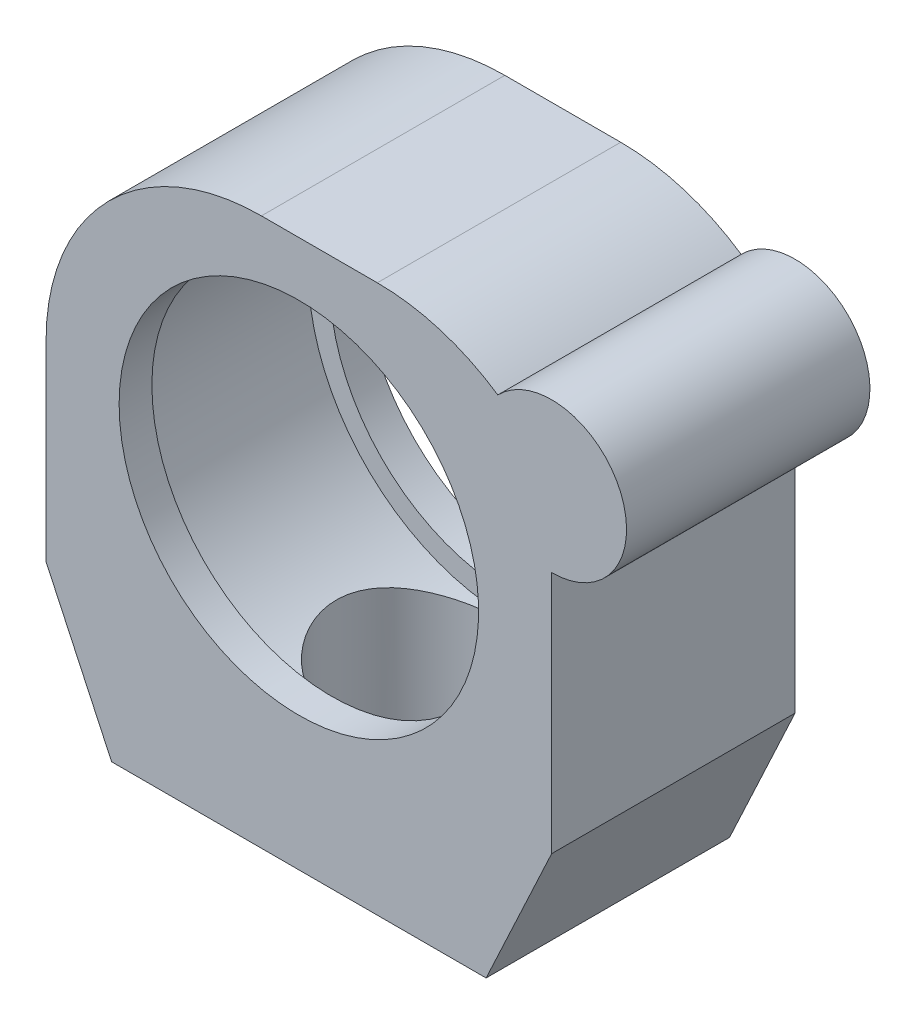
ISO-10303-21;
HEADER;
FILE_DESCRIPTION(('STEP AP214'),'2;1');
FILE_NAME('part.step','',(''),(''),'','','');
FILE_SCHEMA(('AUTOMOTIVE_DESIGN { 1 0 10303 214 1 1 1 1 }'));
ENDSEC;
DATA;
#1=APPLICATION_CONTEXT('core data for automotive mechanical design processes');
#2=APPLICATION_PROTOCOL_DEFINITION('international standard','automotive_design',2000,#1);
#3=PRODUCT_CONTEXT('',#1,'mechanical');
#4=PRODUCT('Part','Part','',(#3));
#5=PRODUCT_RELATED_PRODUCT_CATEGORY('part','',(#4));
#6=PRODUCT_DEFINITION_FORMATION('','',#4);
#7=PRODUCT_DEFINITION_CONTEXT('part definition',#1,'design');
#8=PRODUCT_DEFINITION('design','',#6,#7);
#9=PRODUCT_DEFINITION_SHAPE('','',#8);
#10=(LENGTH_UNIT() NAMED_UNIT(*) SI_UNIT(.MILLI.,.METRE.));
#11=(NAMED_UNIT(*) PLANE_ANGLE_UNIT() SI_UNIT($,.RADIAN.));
#12=(NAMED_UNIT(*) SI_UNIT($,.STERADIAN.) SOLID_ANGLE_UNIT());
#13=UNCERTAINTY_MEASURE_WITH_UNIT(LENGTH_MEASURE(1.E-05),#10,'distance_accuracy_value','');
#14=(GEOMETRIC_REPRESENTATION_CONTEXT(3) GLOBAL_UNCERTAINTY_ASSIGNED_CONTEXT((#13)) GLOBAL_UNIT_ASSIGNED_CONTEXT((#10,
#11,#12)) REPRESENTATION_CONTEXT('',''));
#15=CARTESIAN_POINT('',(0.,0.,0.));
#16=DIRECTION('',(0.,0.,1.));
#17=DIRECTION('',(1.,0.,0.));
#18=AXIS2_PLACEMENT_3D('',#15,#16,#17);
#19=CARTESIAN_POINT('',(0.,0.,13.));
#20=DIRECTION('',(0.,0.,-1.));
#21=DIRECTION('',(-1.,0.,0.));
#22=AXIS2_PLACEMENT_3D('',#19,#20,#21);
#23=CYLINDRICAL_SURFACE('',#22,19.1999999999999);
#24=CARTESIAN_POINT('',(0.,0.,-13.));
#25=DIRECTION('',(0.,0.,-1.));
#26=DIRECTION('',(-1.,0.,0.));
#27=AXIS2_PLACEMENT_3D('',#24,#25,#26);
#28=CIRCLE('',#27,19.1999999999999);
#29=CARTESIAN_POINT('',(-19.1999999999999,0.,-13.));
#30=VERTEX_POINT('',#29);
#31=EDGE_CURVE('E180',#30,#30,#28,.T.);
#32=CARTESIAN_POINT('',(0.,0.,-9.5));
#33=DIRECTION('',(0.,0.,1.));
#34=DIRECTION('',(1.,0.,0.));
#35=AXIS2_PLACEMENT_3D('',#32,#33,#34);
#36=CIRCLE('',#35,19.1999999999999);
#37=CARTESIAN_POINT('',(-19.1999999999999,0.,-9.5));
#38=VERTEX_POINT('',#37);
#39=EDGE_CURVE('E174',#38,#38,#36,.F.);
#40=CARTESIAN_POINT('',(-19.1999999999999,0.,-13.));
#41=CARTESIAN_POINT('',(-19.1999999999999,0.,-12.9635416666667));
#42=CARTESIAN_POINT('',(-19.1999999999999,0.,-12.9270833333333));
#43=CARTESIAN_POINT('',(-19.1999999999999,0.,-12.8541666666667));
#44=CARTESIAN_POINT('',(-19.1999999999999,0.,-12.8177083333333));
#45=CARTESIAN_POINT('',(-19.1999999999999,0.,-12.7447916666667));
#46=CARTESIAN_POINT('',(-19.1999999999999,0.,-12.7083333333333));
#47=CARTESIAN_POINT('',(-19.1999999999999,0.,-12.6354166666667));
#48=CARTESIAN_POINT('',(-19.1999999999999,0.,-12.5989583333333));
#49=CARTESIAN_POINT('',(-19.1999999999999,0.,-12.5260416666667));
#50=CARTESIAN_POINT('',(-19.1999999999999,0.,-12.4895833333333));
#51=CARTESIAN_POINT('',(-19.1999999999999,0.,-12.4166666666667));
#52=CARTESIAN_POINT('',(-19.1999999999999,0.,-12.3802083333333));
#53=CARTESIAN_POINT('',(-19.1999999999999,0.,-12.3072916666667));
#54=CARTESIAN_POINT('',(-19.1999999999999,0.,-12.2708333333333));
#55=CARTESIAN_POINT('',(-19.1999999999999,0.,-12.1979166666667));
#56=CARTESIAN_POINT('',(-19.1999999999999,0.,-12.1614583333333));
#57=CARTESIAN_POINT('',(-19.1999999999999,0.,-12.0885416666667));
#58=CARTESIAN_POINT('',(-19.1999999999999,0.,-12.0520833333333));
#59=CARTESIAN_POINT('',(-19.1999999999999,0.,-11.9791666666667));
#60=CARTESIAN_POINT('',(-19.1999999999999,0.,-11.9427083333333));
#61=CARTESIAN_POINT('',(-19.1999999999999,0.,-11.8697916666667));
#62=CARTESIAN_POINT('',(-19.1999999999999,0.,-11.8333333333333));
#63=CARTESIAN_POINT('',(-19.1999999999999,0.,-11.7604166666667));
#64=CARTESIAN_POINT('',(-19.1999999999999,0.,-11.7239583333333));
#65=CARTESIAN_POINT('',(-19.1999999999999,0.,-11.6510416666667));
#66=CARTESIAN_POINT('',(-19.1999999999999,0.,-11.6145833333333));
#67=CARTESIAN_POINT('',(-19.1999999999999,0.,-11.5416666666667));
#68=CARTESIAN_POINT('',(-19.1999999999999,0.,-11.5052083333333));
#69=CARTESIAN_POINT('',(-19.1999999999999,0.,-11.4322916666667));
#70=CARTESIAN_POINT('',(-19.1999999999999,0.,-11.3958333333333));
#71=CARTESIAN_POINT('',(-19.1999999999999,0.,-11.3229166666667));
#72=CARTESIAN_POINT('',(-19.1999999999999,0.,-11.2864583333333));
#73=CARTESIAN_POINT('',(-19.1999999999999,0.,-11.2135416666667));
#74=CARTESIAN_POINT('',(-19.1999999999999,0.,-11.1770833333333));
#75=CARTESIAN_POINT('',(-19.1999999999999,0.,-11.1041666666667));
#76=CARTESIAN_POINT('',(-19.1999999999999,0.,-11.0677083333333));
#77=CARTESIAN_POINT('',(-19.1999999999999,0.,-10.9947916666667));
#78=CARTESIAN_POINT('',(-19.1999999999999,0.,-10.9583333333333));
#79=CARTESIAN_POINT('',(-19.1999999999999,0.,-10.8854166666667));
#80=CARTESIAN_POINT('',(-19.1999999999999,0.,-10.8489583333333));
#81=CARTESIAN_POINT('',(-19.1999999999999,0.,-10.7760416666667));
#82=CARTESIAN_POINT('',(-19.1999999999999,0.,-10.7395833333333));
#83=CARTESIAN_POINT('',(-19.1999999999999,0.,-10.6666666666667));
#84=CARTESIAN_POINT('',(-19.1999999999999,0.,-10.6302083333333));
#85=CARTESIAN_POINT('',(-19.1999999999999,0.,-10.5572916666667));
#86=CARTESIAN_POINT('',(-19.1999999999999,0.,-10.5208333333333));
#87=CARTESIAN_POINT('',(-19.1999999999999,0.,-10.4479166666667));
#88=CARTESIAN_POINT('',(-19.1999999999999,0.,-10.4114583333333));
#89=CARTESIAN_POINT('',(-19.1999999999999,0.,-10.3385416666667));
#90=CARTESIAN_POINT('',(-19.1999999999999,0.,-10.3020833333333));
#91=CARTESIAN_POINT('',(-19.1999999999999,0.,-10.2291666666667));
#92=CARTESIAN_POINT('',(-19.1999999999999,0.,-10.1927083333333));
#93=CARTESIAN_POINT('',(-19.1999999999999,0.,-10.1197916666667));
#94=CARTESIAN_POINT('',(-19.1999999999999,0.,-10.0833333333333));
#95=CARTESIAN_POINT('',(-19.1999999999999,0.,-10.0104166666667));
#96=CARTESIAN_POINT('',(-19.1999999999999,0.,-9.97395833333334));
#97=CARTESIAN_POINT('',(-19.1999999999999,0.,-9.90104166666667));
#98=CARTESIAN_POINT('',(-19.1999999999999,0.,-9.86458333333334));
#99=CARTESIAN_POINT('',(-19.1999999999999,0.,-9.79166666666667));
#100=CARTESIAN_POINT('',(-19.1999999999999,0.,-9.75520833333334));
#101=CARTESIAN_POINT('',(-19.1999999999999,0.,-9.68229166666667));
#102=CARTESIAN_POINT('',(-19.1999999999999,0.,-9.64583333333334));
#103=CARTESIAN_POINT('',(-19.1999999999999,0.,-9.57291666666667));
#104=CARTESIAN_POINT('',(-19.1999999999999,0.,-9.53645833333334));
#105=CARTESIAN_POINT('',(-19.1999999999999,0.,-9.5));
#106=B_SPLINE_CURVE_WITH_KNOTS('',3,(#40,#41,#42,#43,#44,#45,#46,#47,#48,#49,#50,#51,#52,#53,
#54,#55,#56,#57,#58,#59,#60,#61,#62,#63,#64,#65,#66,#67,#68,#69,#70,#71,#72,#73,#74,#75,#76,#77,
#78,#79,#80,#81,#82,#83,#84,#85,#86,#87,#88,#89,#90,#91,#92,#93,#94,#95,#96,#97,#98,#99,#100,
#101,#102,#103,#104,#105),.UNSPECIFIED.,.F.,.F.,(4,2,2,2,2,2,2,2,2,2,2,2,2,2,2,2,2,2,2,2,2,2,2,
2,2,2,2,2,2,2,2,2,4),(0.,0.109374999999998,0.21875,0.328124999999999,0.4375,0.546874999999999,
0.656250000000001,0.765624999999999,0.875000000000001,0.984374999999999,1.09375,1.203125,1.3125,
1.421875,1.53125,1.640625,1.75,1.859375,1.96875,2.078125,2.1875,2.296875,2.40625,2.515625,2.625,
2.734375,2.84375,2.953125,3.0625,3.171875,3.28125,3.39062499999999,3.5),.UNSPECIFIED.);
#107=EDGE_CURVE('BSEAM32',#30,#38,#106,.T.);
#108=ORIENTED_EDGE('',*,*,#31,.T.);
#109=ORIENTED_EDGE('',*,*,#39,.F.);
#110=ORIENTED_EDGE('',*,*,#107,.T.);
#111=ORIENTED_EDGE('',*,*,#107,.F.);
#112=EDGE_LOOP('',(#108,#110,#109,#111));
#113=FACE_BOUND('',#112,.T.);
#114=ADVANCED_FACE('F32',(#113),#23,.F.);
#115=CARTESIAN_POINT('',(8.37877555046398,1.99999999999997,13.));
#116=DIRECTION('',(0.,0.,-1.));
#117=DIRECTION('',(-1.,0.,0.));
#118=AXIS2_PLACEMENT_3D('',#115,#116,#117);
#119=CYLINDRICAL_SURFACE('',#118,22.9999999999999);
#120=CARTESIAN_POINT('',(8.37877555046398,1.99999999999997,-13.));
#121=DIRECTION('',(0.,0.,-1.));
#122=DIRECTION('',(-1.,0.,0.));
#123=AXIS2_PLACEMENT_3D('',#120,#121,#122);
#124=CIRCLE('',#123,22.9999999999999);
#125=CARTESIAN_POINT('',(8.37877555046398,25.,-13.));
#126=VERTEX_POINT('',#125);
#127=CARTESIAN_POINT('',(21.2494791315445,21.0616103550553,-13.));
#128=VERTEX_POINT('',#127);
#129=EDGE_CURVE('E138',#126,#128,#124,.T.);
#130=ORIENTED_EDGE('',*,*,#129,.F.);
#131=DIRECTION('',(0.,0.,-1.));
#132=VECTOR('',#131,1.);
#133=CARTESIAN_POINT('',(8.37877555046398,25.,13.));
#134=LINE('',#133,#132);
#135=CARTESIAN_POINT('',(8.37877555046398,25.,13.));
#136=VERTEX_POINT('',#135);
#137=EDGE_CURVE('E11',#136,#126,#134,.T.);
#138=ORIENTED_EDGE('',*,*,#137,.F.);
#139=CARTESIAN_POINT('',(8.37877555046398,1.99999999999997,13.));
#140=DIRECTION('',(0.,0.,-1.));
#141=DIRECTION('',(-1.,0.,0.));
#142=AXIS2_PLACEMENT_3D('',#139,#140,#141);
#143=CIRCLE('',#142,22.9999999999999);
#144=CARTESIAN_POINT('',(21.2494791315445,21.0616103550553,13.));
#145=VERTEX_POINT('',#144);
#146=EDGE_CURVE('E162',#136,#145,#143,.T.);
#147=ORIENTED_EDGE('',*,*,#146,.T.);
#148=DIRECTION('',(0.,0.,-1.));
#149=VECTOR('',#148,1.);
#150=CARTESIAN_POINT('',(21.2494791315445,21.0616103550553,13.));
#151=LINE('',#150,#149);
#152=EDGE_CURVE('E93',#145,#128,#151,.T.);
#153=ORIENTED_EDGE('',*,*,#152,.T.);
#154=EDGE_LOOP('',(#130,#138,#147,#153));
#155=FACE_BOUND('',#154,.T.);
#156=ADVANCED_FACE('F34',(#155),#119,.T.);
#157=CARTESIAN_POINT('',(-4.,25.,13.));
#158=DIRECTION('',(0.,1.,0.));
#159=DIRECTION('',(0.,0.,1.));
#160=AXIS2_PLACEMENT_3D('',#157,#158,#159);
#161=PLANE('',#160);
#162=DIRECTION('',(1.,0.,0.));
#163=VECTOR('',#162,1.);
#164=CARTESIAN_POINT('',(-4.,25.,-13.));
#165=LINE('',#164,#163);
#166=CARTESIAN_POINT('',(-4.00000000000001,25.,-13.));
#167=VERTEX_POINT('',#166);
#168=EDGE_CURVE('E160',#167,#126,#165,.T.);
#169=ORIENTED_EDGE('',*,*,#168,.F.);
#170=DIRECTION('',(0.,0.,-1.));
#171=VECTOR('',#170,1.);
#172=CARTESIAN_POINT('',(-4.00000000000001,25.,13.));
#173=LINE('',#172,#171);
#174=CARTESIAN_POINT('',(-4.00000000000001,25.,13.));
#175=VERTEX_POINT('',#174);
#176=EDGE_CURVE('E42',#175,#167,#173,.T.);
#177=ORIENTED_EDGE('',*,*,#176,.F.);
#178=DIRECTION('',(1.,0.,0.));
#179=VECTOR('',#178,1.);
#180=CARTESIAN_POINT('',(-4.,25.,13.));
#181=LINE('',#180,#179);
#182=EDGE_CURVE('E133',#175,#136,#181,.T.);
#183=ORIENTED_EDGE('',*,*,#182,.T.);
#184=ORIENTED_EDGE('',*,*,#137,.T.);
#185=EDGE_LOOP('',(#169,#177,#183,#184));
#186=FACE_BOUND('',#185,.T.);
#187=ADVANCED_FACE('F224',(#186),#161,.T.);
#188=CARTESIAN_POINT('',(-4.,1.99999999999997,13.));
#189=DIRECTION('',(0.,0.,-1.));
#190=DIRECTION('',(-1.,0.,0.));
#191=AXIS2_PLACEMENT_3D('',#188,#189,#190);
#192=CYLINDRICAL_SURFACE('',#191,23.);
#193=CARTESIAN_POINT('',(-4.,1.99999999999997,-13.));
#194=DIRECTION('',(0.,0.,-1.));
#195=DIRECTION('',(-1.,0.,0.));
#196=AXIS2_PLACEMENT_3D('',#193,#194,#195);
#197=CIRCLE('',#196,23.);
#198=CARTESIAN_POINT('',(-27.,1.99999999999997,-13.));
#199=VERTEX_POINT('',#198);
#200=EDGE_CURVE('E129',#199,#167,#197,.T.);
#201=ORIENTED_EDGE('',*,*,#200,.F.);
#202=DIRECTION('',(0.,0.,-1.));
#203=VECTOR('',#202,1.);
#204=CARTESIAN_POINT('',(-27.,1.99999999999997,13.));
#205=LINE('',#204,#203);
#206=CARTESIAN_POINT('',(-27.,1.99999999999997,13.));
#207=VERTEX_POINT('',#206);
#208=EDGE_CURVE('E117',#207,#199,#205,.T.);
#209=ORIENTED_EDGE('',*,*,#208,.F.);
#210=CARTESIAN_POINT('',(-4.,1.99999999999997,13.));
#211=DIRECTION('',(0.,0.,-1.));
#212=DIRECTION('',(-1.,0.,0.));
#213=AXIS2_PLACEMENT_3D('',#210,#211,#212);
#214=CIRCLE('',#213,23.);
#215=EDGE_CURVE('E124',#207,#175,#214,.T.);
#216=ORIENTED_EDGE('',*,*,#215,.T.);
#217=ORIENTED_EDGE('',*,*,#176,.T.);
#218=EDGE_LOOP('',(#201,#209,#216,#217));
#219=FACE_BOUND('',#218,.T.);
#220=ADVANCED_FACE('F127',(#219),#192,.T.);
#221=CARTESIAN_POINT('',(-27.,1.99999999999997,13.));
#222=DIRECTION('',(-1.,0.,0.));
#223=DIRECTION('',(0.,0.,1.));
#224=AXIS2_PLACEMENT_3D('',#221,#222,#223);
#225=PLANE('',#224);
#226=DIRECTION('',(0.,1.,0.));
#227=VECTOR('',#226,1.);
#228=CARTESIAN_POINT('',(-27.,1.99999999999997,-13.));
#229=LINE('',#228,#227);
#230=CARTESIAN_POINT('',(-27.,-18.5,-13.));
#231=VERTEX_POINT('',#230);
#232=EDGE_CURVE('E157',#231,#199,#229,.T.);
#233=ORIENTED_EDGE('',*,*,#232,.F.);
#234=DIRECTION('',(0.,0.,-1.));
#235=VECTOR('',#234,1.);
#236=CARTESIAN_POINT('',(-27.,-18.5,13.));
#237=LINE('',#236,#235);
#238=CARTESIAN_POINT('',(-27.,-18.5,13.));
#239=VERTEX_POINT('',#238);
#240=EDGE_CURVE('E119',#239,#231,#237,.T.);
#241=ORIENTED_EDGE('',*,*,#240,.F.);
#242=DIRECTION('',(0.,1.,0.));
#243=VECTOR('',#242,1.);
#244=CARTESIAN_POINT('',(-27.,-18.5,13.));
#245=LINE('',#244,#243);
#246=EDGE_CURVE('E114',#239,#207,#245,.T.);
#247=ORIENTED_EDGE('',*,*,#246,.T.);
#248=ORIENTED_EDGE('',*,*,#208,.T.);
#249=EDGE_LOOP('',(#233,#241,#247,#248));
#250=FACE_BOUND('',#249,.T.);
#251=ADVANCED_FACE('F116',(#250),#225,.T.);
#252=CARTESIAN_POINT('',(-20.,-33.5,13.));
#253=DIRECTION('',(-0.906183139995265,-0.422885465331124,0.));
#254=DIRECTION('',(0.422885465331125,-0.906183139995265,0.));
#255=AXIS2_PLACEMENT_3D('',#252,#253,#254);
#256=PLANE('',#255);
#257=DIRECTION('',(-0.422885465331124,0.906183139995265,0.));
#258=VECTOR('',#257,1.);
#259=CARTESIAN_POINT('',(-20.,-33.5,-13.));
#260=LINE('',#259,#258);
#261=CARTESIAN_POINT('',(-20.,-33.5,-13.));
#262=VERTEX_POINT('',#261);
#263=EDGE_CURVE('E154',#262,#231,#260,.T.);
#264=ORIENTED_EDGE('',*,*,#263,.F.);
#265=DIRECTION('',(0.,0.,-1.));
#266=VECTOR('',#265,1.);
#267=CARTESIAN_POINT('',(-20.,-33.5,13.));
#268=LINE('',#267,#266);
#269=CARTESIAN_POINT('',(-20.,-33.5,13.));
#270=VERTEX_POINT('',#269);
#271=EDGE_CURVE('E166',#270,#262,#268,.T.);
#272=ORIENTED_EDGE('',*,*,#271,.F.);
#273=DIRECTION('',(-0.422885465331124,0.906183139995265,0.));
#274=VECTOR('',#273,1.);
#275=CARTESIAN_POINT('',(-20.,-33.5,13.));
#276=LINE('',#275,#274);
#277=EDGE_CURVE('E125',#270,#239,#276,.T.);
#278=ORIENTED_EDGE('',*,*,#277,.T.);
#279=ORIENTED_EDGE('',*,*,#240,.T.);
#280=EDGE_LOOP('',(#264,#272,#278,#279));
#281=FACE_BOUND('',#280,.T.);
#282=ADVANCED_FACE('F208',(#281),#256,.T.);
#283=CARTESIAN_POINT('',(20.,-33.5,13.));
#284=DIRECTION('',(0.,-1.,0.));
#285=DIRECTION('',(0.,0.,-1.));
#286=AXIS2_PLACEMENT_3D('',#283,#284,#285);
#287=PLANE('',#286);
#288=CARTESIAN_POINT('',(15.,-33.5,0.));
#289=DIRECTION('',(0.,-1.,0.));
#290=DIRECTION('',(0.,0.,-1.));
#291=AXIS2_PLACEMENT_3D('',#288,#289,#290);
#292=CIRCLE('',#291,2.99999999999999);
#293=CARTESIAN_POINT('',(15.,-33.5,-2.99999999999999));
#294=VERTEX_POINT('',#293);
#295=EDGE_CURVE('E417',#294,#294,#292,.T.);
#296=ORIENTED_EDGE('',*,*,#295,.F.);
#297=EDGE_LOOP('',(#296));
#298=FACE_BOUND('',#297,.T.);
#299=CARTESIAN_POINT('',(-15.,-33.5,0.));
#300=DIRECTION('',(0.,-1.,0.));
#301=DIRECTION('',(0.,0.,-1.));
#302=AXIS2_PLACEMENT_3D('',#299,#300,#301);
#303=CIRCLE('',#302,2.99999999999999);
#304=CARTESIAN_POINT('',(-15.,-33.5,-2.99999999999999));
#305=VERTEX_POINT('',#304);
#306=EDGE_CURVE('E411',#305,#305,#303,.T.);
#307=ORIENTED_EDGE('',*,*,#306,.F.);
#308=EDGE_LOOP('',(#307));
#309=FACE_BOUND('',#308,.T.);
#310=CARTESIAN_POINT('',(0.,-33.5,0.));
#311=DIRECTION('',(0.,-1.,0.));
#312=DIRECTION('',(0.,0.,-1.));
#313=AXIS2_PLACEMENT_3D('',#310,#311,#312);
#314=CIRCLE('',#313,9.00000000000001);
#315=CARTESIAN_POINT('',(0.,-33.5,-9.00000000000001));
#316=VERTEX_POINT('',#315);
#317=EDGE_CURVE('E187',#316,#316,#314,.T.);
#318=ORIENTED_EDGE('',*,*,#317,.F.);
#319=EDGE_LOOP('',(#318));
#320=FACE_BOUND('',#319,.T.);
#321=DIRECTION('',(-1.,0.,0.));
#322=VECTOR('',#321,1.);
#323=CARTESIAN_POINT('',(20.,-33.5,-13.));
#324=LINE('',#323,#322);
#325=CARTESIAN_POINT('',(20.,-33.5,-13.));
#326=VERTEX_POINT('',#325);
#327=EDGE_CURVE('E151',#326,#262,#324,.T.);
#328=ORIENTED_EDGE('',*,*,#327,.F.);
#329=DIRECTION('',(0.,0.,-1.));
#330=VECTOR('',#329,1.);
#331=CARTESIAN_POINT('',(20.,-33.5,13.));
#332=LINE('',#331,#330);
#333=CARTESIAN_POINT('',(20.,-33.5,13.));
#334=VERTEX_POINT('',#333);
#335=EDGE_CURVE('E168',#334,#326,#332,.T.);
#336=ORIENTED_EDGE('',*,*,#335,.F.);
#337=DIRECTION('',(-1.,0.,0.));
#338=VECTOR('',#337,1.);
#339=CARTESIAN_POINT('',(20.,-33.5,13.));
#340=LINE('',#339,#338);
#341=EDGE_CURVE('E204',#334,#270,#340,.T.);
#342=ORIENTED_EDGE('',*,*,#341,.T.);
#343=ORIENTED_EDGE('',*,*,#271,.T.);
#344=EDGE_LOOP('',(#328,#336,#342,#343));
#345=FACE_BOUND('',#344,.T.);
#346=ADVANCED_FACE('F213',(#298,#309,#320,#345),#287,.T.);
#347=CARTESIAN_POINT('',(27.,-18.5,13.));
#348=DIRECTION('',(0.906183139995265,-0.422885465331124,0.));
#349=DIRECTION('',(0.422885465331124,0.906183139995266,0.));
#350=AXIS2_PLACEMENT_3D('',#347,#348,#349);
#351=PLANE('',#350);
#352=DIRECTION('',(-0.422885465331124,-0.906183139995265,0.));
#353=VECTOR('',#352,1.);
#354=CARTESIAN_POINT('',(27.,-18.5,-13.));
#355=LINE('',#354,#353);
#356=CARTESIAN_POINT('',(27.,-18.5,-13.));
#357=VERTEX_POINT('',#356);
#358=EDGE_CURVE('E148',#357,#326,#355,.T.);
#359=ORIENTED_EDGE('',*,*,#358,.F.);
#360=DIRECTION('',(0.,0.,-1.));
#361=VECTOR('',#360,1.);
#362=CARTESIAN_POINT('',(27.,-18.5,13.));
#363=LINE('',#362,#361);
#364=CARTESIAN_POINT('',(27.,-18.5,13.));
#365=VERTEX_POINT('',#364);
#366=EDGE_CURVE('E170',#365,#357,#363,.T.);
#367=ORIENTED_EDGE('',*,*,#366,.F.);
#368=DIRECTION('',(-0.422885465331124,-0.906183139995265,0.));
#369=VECTOR('',#368,1.);
#370=CARTESIAN_POINT('',(27.,-18.5,13.));
#371=LINE('',#370,#369);
#372=EDGE_CURVE('E201',#365,#334,#371,.T.);
#373=ORIENTED_EDGE('',*,*,#372,.T.);
#374=ORIENTED_EDGE('',*,*,#335,.T.);
#375=EDGE_LOOP('',(#359,#367,#373,#374));
#376=FACE_BOUND('',#375,.T.);
#377=ADVANCED_FACE('F216',(#376),#351,.T.);
#378=CARTESIAN_POINT('',(27.,7.49999999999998,13.));
#379=DIRECTION('',(1.,0.,0.));
#380=DIRECTION('',(0.,0.,-1.));
#381=AXIS2_PLACEMENT_3D('',#378,#379,#380);
#382=PLANE('',#381);
#383=DIRECTION('',(0.,-1.,0.));
#384=VECTOR('',#383,1.);
#385=CARTESIAN_POINT('',(27.,7.49999999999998,-13.));
#386=LINE('',#385,#384);
#387=CARTESIAN_POINT('',(27.,7.49999999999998,-13.));
#388=VERTEX_POINT('',#387);
#389=EDGE_CURVE('E145',#388,#357,#386,.T.);
#390=ORIENTED_EDGE('',*,*,#389,.F.);
#391=DIRECTION('',(0.,0.,-1.));
#392=VECTOR('',#391,1.);
#393=CARTESIAN_POINT('',(27.,7.49999999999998,13.));
#394=LINE('',#393,#392);
#395=CARTESIAN_POINT('',(27.,7.49999999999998,13.));
#396=VERTEX_POINT('',#395);
#397=EDGE_CURVE('E172',#396,#388,#394,.T.);
#398=ORIENTED_EDGE('',*,*,#397,.F.);
#399=DIRECTION('',(0.,-1.,0.));
#400=VECTOR('',#399,1.);
#401=CARTESIAN_POINT('',(27.,7.49999999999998,13.));
#402=LINE('',#401,#400);
#403=EDGE_CURVE('E198',#396,#365,#402,.T.);
#404=ORIENTED_EDGE('',*,*,#403,.T.);
#405=ORIENTED_EDGE('',*,*,#366,.T.);
#406=EDGE_LOOP('',(#390,#398,#404,#405));
#407=FACE_BOUND('',#406,.T.);
#408=ADVANCED_FACE('F220',(#407),#382,.T.);
#409=CARTESIAN_POINT('',(27.,15.5,13.));
#410=DIRECTION('',(0.,0.,-1.));
#411=DIRECTION('',(-1.,0.,0.));
#412=AXIS2_PLACEMENT_3D('',#409,#410,#411);
#413=CYLINDRICAL_SURFACE('',#412,8.00000000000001);
#414=CARTESIAN_POINT('',(27.,15.5,-13.));
#415=DIRECTION('',(0.,0.,-1.));
#416=DIRECTION('',(-1.,0.,0.));
#417=AXIS2_PLACEMENT_3D('',#414,#415,#416);
#418=CIRCLE('',#417,8.00000000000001);
#419=EDGE_CURVE('E141',#128,#388,#418,.T.);
#420=ORIENTED_EDGE('',*,*,#419,.F.);
#421=ORIENTED_EDGE('',*,*,#152,.F.);
#422=CARTESIAN_POINT('',(27.,15.5,13.));
#423=DIRECTION('',(0.,0.,-1.));
#424=DIRECTION('',(-1.,0.,0.));
#425=AXIS2_PLACEMENT_3D('',#422,#423,#424);
#426=CIRCLE('',#425,8.00000000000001);
#427=EDGE_CURVE('E196',#145,#396,#426,.T.);
#428=ORIENTED_EDGE('',*,*,#427,.T.);
#429=ORIENTED_EDGE('',*,*,#397,.T.);
#430=EDGE_LOOP('',(#420,#421,#428,#429));
#431=FACE_BOUND('',#430,.T.);
#432=ADVANCED_FACE('F221',(#431),#413,.T.);
#433=CARTESIAN_POINT('',(8.37877555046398,1.99999999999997,13.));
#434=DIRECTION('',(0.,0.,-1.));
#435=DIRECTION('',(-1.,0.,0.));
#436=AXIS2_PLACEMENT_3D('',#433,#434,#435);
#437=PLANE('',#436);
#438=CARTESIAN_POINT('',(0.,0.,13.));
#439=DIRECTION('',(0.,0.,-1.));
#440=DIRECTION('',(-1.,0.,0.));
#441=AXIS2_PLACEMENT_3D('',#438,#439,#440);
#442=CIRCLE('',#441,19.1999999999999);
#443=CARTESIAN_POINT('',(-19.1999999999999,0.,13.));
#444=VERTEX_POINT('',#443);
#445=EDGE_CURVE('E142',#444,#444,#442,.T.);
#446=ORIENTED_EDGE('',*,*,#445,.T.);
#447=EDGE_LOOP('',(#446));
#448=FACE_BOUND('',#447,.T.);
#449=ORIENTED_EDGE('',*,*,#146,.F.);
#450=ORIENTED_EDGE('',*,*,#182,.F.);
#451=ORIENTED_EDGE('',*,*,#215,.F.);
#452=ORIENTED_EDGE('',*,*,#246,.F.);
#453=ORIENTED_EDGE('',*,*,#277,.F.);
#454=ORIENTED_EDGE('',*,*,#341,.F.);
#455=ORIENTED_EDGE('',*,*,#372,.F.);
#456=ORIENTED_EDGE('',*,*,#403,.F.);
#457=ORIENTED_EDGE('',*,*,#427,.F.);
#458=EDGE_LOOP('',(#449,#450,#451,#452,#453,#454,#455,#456,#457));
#459=FACE_BOUND('',#458,.T.);
#460=ADVANCED_FACE('F132',(#448,#459),#437,.F.);
#461=CARTESIAN_POINT('',(8.37877555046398,1.99999999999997,-13.));
#462=DIRECTION('',(0.,0.,-1.));
#463=DIRECTION('',(-1.,0.,0.));
#464=AXIS2_PLACEMENT_3D('',#461,#462,#463);
#465=PLANE('',#464);
#466=ORIENTED_EDGE('',*,*,#31,.F.);
#467=EDGE_LOOP('',(#466));
#468=FACE_BOUND('',#467,.T.);
#469=ORIENTED_EDGE('',*,*,#129,.T.);
#470=ORIENTED_EDGE('',*,*,#419,.T.);
#471=ORIENTED_EDGE('',*,*,#389,.T.);
#472=ORIENTED_EDGE('',*,*,#358,.T.);
#473=ORIENTED_EDGE('',*,*,#327,.T.);
#474=ORIENTED_EDGE('',*,*,#263,.T.);
#475=ORIENTED_EDGE('',*,*,#232,.T.);
#476=ORIENTED_EDGE('',*,*,#200,.T.);
#477=ORIENTED_EDGE('',*,*,#168,.T.);
#478=EDGE_LOOP('',(#469,#470,#471,#472,#473,#474,#475,#476,#477));
#479=FACE_BOUND('',#478,.T.);
#480=ADVANCED_FACE('F223',(#468,#479),#465,.T.);
#481=CARTESIAN_POINT('',(0.,0.,9.5));
#482=DIRECTION('',(0.,0.,1.));
#483=DIRECTION('',(1.,0.,0.));
#484=AXIS2_PLACEMENT_3D('',#481,#482,#483);
#485=CIRCLE('',#484,19.1999999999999);
#486=CARTESIAN_POINT('',(-19.1999999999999,0.,9.5));
#487=VERTEX_POINT('',#486);
#488=EDGE_CURVE('E36',#487,#487,#485,.F.);
#489=CARTESIAN_POINT('',(-19.1999999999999,0.,9.5));
#490=CARTESIAN_POINT('',(-19.1999999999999,0.,9.53645833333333));
#491=CARTESIAN_POINT('',(-19.1999999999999,0.,9.57291666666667));
#492=CARTESIAN_POINT('',(-19.1999999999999,0.,9.64583333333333));
#493=CARTESIAN_POINT('',(-19.1999999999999,0.,9.68229166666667));
#494=CARTESIAN_POINT('',(-19.1999999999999,0.,9.75520833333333));
#495=CARTESIAN_POINT('',(-19.1999999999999,0.,9.79166666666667));
#496=CARTESIAN_POINT('',(-19.1999999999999,0.,9.86458333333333));
#497=CARTESIAN_POINT('',(-19.1999999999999,0.,9.90104166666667));
#498=CARTESIAN_POINT('',(-19.1999999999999,0.,9.97395833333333));
#499=CARTESIAN_POINT('',(-19.1999999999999,0.,10.0104166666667));
#500=CARTESIAN_POINT('',(-19.1999999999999,0.,10.0833333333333));
#501=CARTESIAN_POINT('',(-19.1999999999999,0.,10.1197916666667));
#502=CARTESIAN_POINT('',(-19.1999999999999,0.,10.1927083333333));
#503=CARTESIAN_POINT('',(-19.1999999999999,0.,10.2291666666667));
#504=CARTESIAN_POINT('',(-19.1999999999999,0.,10.3020833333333));
#505=CARTESIAN_POINT('',(-19.1999999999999,0.,10.3385416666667));
#506=CARTESIAN_POINT('',(-19.1999999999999,0.,10.4114583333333));
#507=CARTESIAN_POINT('',(-19.1999999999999,0.,10.4479166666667));
#508=CARTESIAN_POINT('',(-19.1999999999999,0.,10.5208333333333));
#509=CARTESIAN_POINT('',(-19.1999999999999,0.,10.5572916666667));
#510=CARTESIAN_POINT('',(-19.1999999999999,0.,10.6302083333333));
#511=CARTESIAN_POINT('',(-19.1999999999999,0.,10.6666666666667));
#512=CARTESIAN_POINT('',(-19.1999999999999,0.,10.7395833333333));
#513=CARTESIAN_POINT('',(-19.1999999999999,0.,10.7760416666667));
#514=CARTESIAN_POINT('',(-19.1999999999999,0.,10.8489583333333));
#515=CARTESIAN_POINT('',(-19.1999999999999,0.,10.8854166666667));
#516=CARTESIAN_POINT('',(-19.1999999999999,0.,10.9583333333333));
#517=CARTESIAN_POINT('',(-19.1999999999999,0.,10.9947916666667));
#518=CARTESIAN_POINT('',(-19.1999999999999,0.,11.0677083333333));
#519=CARTESIAN_POINT('',(-19.1999999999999,0.,11.1041666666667));
#520=CARTESIAN_POINT('',(-19.1999999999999,0.,11.1770833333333));
#521=CARTESIAN_POINT('',(-19.1999999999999,0.,11.2135416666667));
#522=CARTESIAN_POINT('',(-19.1999999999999,0.,11.2864583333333));
#523=CARTESIAN_POINT('',(-19.1999999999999,0.,11.3229166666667));
#524=CARTESIAN_POINT('',(-19.1999999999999,0.,11.3958333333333));
#525=CARTESIAN_POINT('',(-19.1999999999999,0.,11.4322916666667));
#526=CARTESIAN_POINT('',(-19.1999999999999,0.,11.5052083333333));
#527=CARTESIAN_POINT('',(-19.1999999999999,0.,11.5416666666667));
#528=CARTESIAN_POINT('',(-19.1999999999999,0.,11.6145833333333));
#529=CARTESIAN_POINT('',(-19.1999999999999,0.,11.6510416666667));
#530=CARTESIAN_POINT('',(-19.1999999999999,0.,11.7239583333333));
#531=CARTESIAN_POINT('',(-19.1999999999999,0.,11.7604166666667));
#532=CARTESIAN_POINT('',(-19.1999999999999,0.,11.8333333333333));
#533=CARTESIAN_POINT('',(-19.1999999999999,0.,11.8697916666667));
#534=CARTESIAN_POINT('',(-19.1999999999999,0.,11.9427083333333));
#535=CARTESIAN_POINT('',(-19.1999999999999,0.,11.9791666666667));
#536=CARTESIAN_POINT('',(-19.1999999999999,0.,12.0520833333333));
#537=CARTESIAN_POINT('',(-19.1999999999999,0.,12.0885416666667));
#538=CARTESIAN_POINT('',(-19.1999999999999,0.,12.1614583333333));
#539=CARTESIAN_POINT('',(-19.1999999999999,0.,12.1979166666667));
#540=CARTESIAN_POINT('',(-19.1999999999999,0.,12.2708333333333));
#541=CARTESIAN_POINT('',(-19.1999999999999,0.,12.3072916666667));
#542=CARTESIAN_POINT('',(-19.1999999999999,0.,12.3802083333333));
#543=CARTESIAN_POINT('',(-19.1999999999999,0.,12.4166666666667));
#544=CARTESIAN_POINT('',(-19.1999999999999,0.,12.4895833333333));
#545=CARTESIAN_POINT('',(-19.1999999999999,0.,12.5260416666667));
#546=CARTESIAN_POINT('',(-19.1999999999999,0.,12.5989583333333));
#547=CARTESIAN_POINT('',(-19.1999999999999,0.,12.6354166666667));
#548=CARTESIAN_POINT('',(-19.1999999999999,0.,12.7083333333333));
#549=CARTESIAN_POINT('',(-19.1999999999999,0.,12.7447916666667));
#550=CARTESIAN_POINT('',(-19.1999999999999,0.,12.8177083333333));
#551=CARTESIAN_POINT('',(-19.1999999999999,0.,12.8541666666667));
#552=CARTESIAN_POINT('',(-19.1999999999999,0.,12.9270833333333));
#553=CARTESIAN_POINT('',(-19.1999999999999,0.,12.9635416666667));
#554=CARTESIAN_POINT('',(-19.1999999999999,0.,13.));
#555=B_SPLINE_CURVE_WITH_KNOTS('',3,(#489,#490,#491,#492,#493,#494,#495,#496,#497,#498,#499,
#500,#501,#502,#503,#504,#505,#506,#507,#508,#509,#510,#511,#512,#513,#514,#515,#516,#517,#518,
#519,#520,#521,#522,#523,#524,#525,#526,#527,#528,#529,#530,#531,#532,#533,#534,#535,#536,#537,
#538,#539,#540,#541,#542,#543,#544,#545,#546,#547,#548,#549,#550,#551,#552,#553,#554),
.UNSPECIFIED.,.F.,.F.,(4,2,2,2,2,2,2,2,2,2,2,2,2,2,2,2,2,2,2,2,2,2,2,2,2,2,2,2,2,2,2,2,4),(0.,
0.109375,0.21875,0.328125,0.4375,0.546875,0.656249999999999,0.765625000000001,0.874999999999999,
0.984375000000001,1.09375,1.203125,1.3125,1.421875,1.53125,1.640625,1.75,1.859375,1.96875,
2.078125,2.1875,2.296875,2.40625,2.515625,2.625,2.734375,2.84375,2.953125,3.0625,3.171875,
3.28125,3.390625,3.5),.UNSPECIFIED.);
#556=EDGE_CURVE('BSEAM236',#487,#444,#555,.T.);
#557=ORIENTED_EDGE('',*,*,#488,.T.);
#558=ORIENTED_EDGE('',*,*,#445,.F.);
#559=ORIENTED_EDGE('',*,*,#556,.T.);
#560=ORIENTED_EDGE('',*,*,#556,.F.);
#561=EDGE_LOOP('',(#557,#559,#558,#560));
#562=FACE_BOUND('',#561,.T.);
#563=ADVANCED_FACE('F236',(#562),#23,.F.);
#564=CARTESIAN_POINT('',(0.,0.,9.5));
#565=DIRECTION('',(0.,0.,1.));
#566=DIRECTION('',(1.,0.,0.));
#567=AXIS2_PLACEMENT_3D('',#564,#565,#566);
#568=PLANE('',#567);
#569=CARTESIAN_POINT('',(0.,0.,9.5));
#570=DIRECTION('',(0.,0.,1.));
#571=DIRECTION('',(1.,0.,0.));
#572=AXIS2_PLACEMENT_3D('',#569,#570,#571);
#573=CIRCLE('',#572,21.5);
#574=CARTESIAN_POINT('',(21.5,0.,9.5));
#575=VERTEX_POINT('',#574);
#576=EDGE_CURVE('E176',#575,#575,#573,.T.);
#577=ORIENTED_EDGE('',*,*,#576,.F.);
#578=EDGE_LOOP('',(#577));
#579=FACE_BOUND('',#578,.T.);
#580=ORIENTED_EDGE('',*,*,#488,.F.);
#581=EDGE_LOOP('',(#580));
#582=FACE_BOUND('',#581,.T.);
#583=ADVANCED_FACE('F243',(#579,#582),#568,.F.);
#584=CARTESIAN_POINT('',(0.,0.,-9.5));
#585=DIRECTION('',(0.,0.,1.));
#586=DIRECTION('',(1.,0.,0.));
#587=AXIS2_PLACEMENT_3D('',#584,#585,#586);
#588=PLANE('',#587);
#589=CARTESIAN_POINT('',(0.,0.,-9.5));
#590=DIRECTION('',(0.,0.,1.));
#591=DIRECTION('',(1.,0.,0.));
#592=AXIS2_PLACEMENT_3D('',#589,#590,#591);
#593=CIRCLE('',#592,21.5);
#594=CARTESIAN_POINT('',(21.5,0.,-9.5));
#595=VERTEX_POINT('',#594);
#596=EDGE_CURVE('E182',#595,#595,#593,.T.);
#597=ORIENTED_EDGE('',*,*,#596,.T.);
#598=EDGE_LOOP('',(#597));
#599=FACE_BOUND('',#598,.T.);
#600=ORIENTED_EDGE('',*,*,#39,.T.);
#601=EDGE_LOOP('',(#600));
#602=FACE_BOUND('',#601,.T.);
#603=ADVANCED_FACE('F249',(#599,#602),#588,.T.);
#604=CARTESIAN_POINT('',(0.,0.,9.5));
#605=DIRECTION('',(0.,0.,-1.));
#606=DIRECTION('',(-1.,0.,0.));
#607=AXIS2_PLACEMENT_3D('',#604,#605,#606);
#608=CYLINDRICAL_SURFACE('',#607,21.5);
#609=CARTESIAN_POINT('',(0.,-21.5,-9.00000000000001));
#610=CARTESIAN_POINT('',(0.241050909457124,-21.4999986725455,-8.99999834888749));
#611=CARTESIAN_POINT('',(0.482181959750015,-21.4959350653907,-8.99030264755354));
#612=CARTESIAN_POINT('',(0.962725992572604,-21.4797818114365,-8.95161032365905));
#613=CARTESIAN_POINT('',(1.20213779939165,-21.4676871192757,-8.92260156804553));
#614=CARTESIAN_POINT('',(1.6778966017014,-21.4357556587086,-8.84549912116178));
#615=CARTESIAN_POINT('',(1.91423563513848,-21.4159018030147,-8.79736330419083));
#616=CARTESIAN_POINT('',(2.3816242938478,-21.3689738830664,-8.68249903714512));
#617=CARTESIAN_POINT('',(2.61267355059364,-21.3418993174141,-8.61576929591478));
#618=CARTESIAN_POINT('',(3.06712559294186,-21.2813324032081,-8.46462538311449));
#619=CARTESIAN_POINT('',(3.29055232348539,-21.2478628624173,-8.38027396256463));
#620=CARTESIAN_POINT('',(3.72922910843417,-21.1752755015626,-8.19448602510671));
#621=CARTESIAN_POINT('',(3.94447887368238,-21.1361574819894,-8.09304890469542));
#622=CARTESIAN_POINT('',(4.36545919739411,-21.0532360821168,-7.87394609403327));
#623=CARTESIAN_POINT('',(4.57119501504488,-21.0094353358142,-7.75628951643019));
#624=CARTESIAN_POINT('',(4.97221093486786,-20.9181618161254,-7.5055387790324));
#625=CARTESIAN_POINT('',(5.16748716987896,-20.8706877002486,-7.37243896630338));
#626=CARTESIAN_POINT('',(5.75345704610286,-20.7199136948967,-6.93835991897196));
#627=CARTESIAN_POINT('',(6.12505046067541,-20.6121878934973,-6.61257978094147));
#628=CARTESIAN_POINT('',(6.81013710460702,-20.3961152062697,-5.90464526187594));
#629=CARTESIAN_POINT('',(7.12359947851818,-20.2877680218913,-5.52246113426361));
#630=CARTESIAN_POINT('',(7.55149688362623,-20.1308116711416,-4.90328527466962));
#631=CARTESIAN_POINT('',(7.68979323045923,-20.078251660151,-4.68345087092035));
#632=CARTESIAN_POINT('',(7.94723986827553,-19.9777490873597,-4.23188400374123));
#633=CARTESIAN_POINT('',(8.06639808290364,-19.9298046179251,-4.00015651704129));
#634=CARTESIAN_POINT('',(8.28452495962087,-19.8401251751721,-3.52628458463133));
#635=CARTESIAN_POINT('',(8.38349725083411,-19.7983890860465,-3.28414202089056));
#636=CARTESIAN_POINT('',(8.56028218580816,-19.7225969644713,-2.79108130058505));
#637=CARTESIAN_POINT('',(8.63809642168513,-19.6885403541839,-2.54016380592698));
#638=CARTESIAN_POINT('',(8.76843340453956,-19.6308280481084,-2.04381713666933));
#639=CARTESIAN_POINT('',(8.8219988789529,-19.6067483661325,-1.79871107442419));
#640=CARTESIAN_POINT('',(8.90854239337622,-19.5675787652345,-1.30417567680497));
#641=CARTESIAN_POINT('',(8.94152107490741,-19.5524885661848,-1.05474647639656));
#642=CARTESIAN_POINT('',(8.98646855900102,-19.5318713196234,-0.553727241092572));
#643=CARTESIAN_POINT('',(8.99844744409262,-19.5263396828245,-0.302138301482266));
#644=CARTESIAN_POINT('',(9.00126940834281,-19.5250392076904,0.201176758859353));
#645=CARTESIAN_POINT('',(8.99211361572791,-19.5292698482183,0.452902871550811));
#646=CARTESIAN_POINT('',(8.95432327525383,-19.5466230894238,0.934823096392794));
#647=CARTESIAN_POINT('',(8.92725992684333,-19.5590281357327,1.16516845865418));
#648=CARTESIAN_POINT('',(8.85554613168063,-19.5916015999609,1.62262792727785));
#649=CARTESIAN_POINT('',(8.81088964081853,-19.6117726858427,1.84974089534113));
#650=CARTESIAN_POINT('',(8.70445260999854,-19.65924443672,2.29908855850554));
#651=CARTESIAN_POINT('',(8.64267614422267,-19.686543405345,2.521324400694));
#652=CARTESIAN_POINT('',(8.50253864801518,-19.7474724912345,2.9596982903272));
#653=CARTESIAN_POINT('',(8.42417111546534,-19.7811050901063,3.17583390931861));
#654=CARTESIAN_POINT('',(8.2497088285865,-19.8545068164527,3.60515058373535));
#655=CARTESIAN_POINT('',(8.15327762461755,-19.8943895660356,3.81817532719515));
#656=CARTESIAN_POINT('',(7.94451542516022,-19.9786722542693,4.23546105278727));
#657=CARTESIAN_POINT('',(7.83217755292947,-20.0230741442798,4.43971819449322));
#658=CARTESIAN_POINT('',(7.59237676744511,-20.1152258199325,4.83838096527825));
#659=CARTESIAN_POINT('',(7.46491233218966,-20.1629759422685,5.03278560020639));
#660=CARTESIAN_POINT('',(7.19562316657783,-20.2606396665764,5.41081047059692));
#661=CARTESIAN_POINT('',(7.05379762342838,-20.3105533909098,5.59443009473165));
#662=CARTESIAN_POINT('',(6.7438097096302,-20.4156815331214,5.96525956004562));
#663=CARTESIAN_POINT('',(6.57443203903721,-20.470983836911,6.15143026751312));
#664=CARTESIAN_POINT('',(6.22069356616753,-20.5812360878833,6.50893152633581));
#665=CARTESIAN_POINT('',(6.03633749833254,-20.6361861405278,6.68026673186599));
#666=CARTESIAN_POINT('',(5.65349639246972,-20.7443380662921,7.00723792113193));
#667=CARTESIAN_POINT('',(5.45500256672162,-20.7975388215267,7.16286399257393));
#668=CARTESIAN_POINT('',(5.04517902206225,-20.900736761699,7.45719710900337));
#669=CARTESIAN_POINT('',(4.83385450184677,-20.9507352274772,7.59591093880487));
#670=CARTESIAN_POINT('',(4.39434252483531,-21.0473648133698,7.85855170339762));
#671=CARTESIAN_POINT('',(4.16587342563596,-21.0938874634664,7.98204811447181));
#672=CARTESIAN_POINT('',(3.69815912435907,-21.1808921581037,8.20921471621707));
#673=CARTESIAN_POINT('',(3.4589136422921,-21.2213740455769,8.31288439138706));
#674=CARTESIAN_POINT('',(2.97144874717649,-21.2950985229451,8.49932663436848));
#675=CARTESIAN_POINT('',(2.7232334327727,-21.3283443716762,8.58210861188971));
#676=CARTESIAN_POINT('',(2.21964158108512,-21.3866177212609,8.72592381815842));
#677=CARTESIAN_POINT('',(1.96426559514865,-21.4116458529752,8.78695871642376));
#678=CARTESIAN_POINT('',(1.46490654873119,-21.4514040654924,8.88338529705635));
#679=CARTESIAN_POINT('',(1.22123465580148,-21.4666887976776,8.92016334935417));
#680=CARTESIAN_POINT('',(0.7313208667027,-21.4889572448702,8.97362124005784));
#681=CARTESIAN_POINT('',(0.48507907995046,-21.4959413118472,8.99030193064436));
#682=CARTESIAN_POINT('',(-0.00797375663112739,-21.5014117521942,9.00337391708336));
#683=CARTESIAN_POINT('',(-0.254784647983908,-21.4999002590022,8.99977030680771));
#684=CARTESIAN_POINT('',(-0.747077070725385,-21.4884269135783,8.972326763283));
#685=CARTESIAN_POINT('',(-0.992558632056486,-21.4784652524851,8.9484872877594));
#686=CARTESIAN_POINT('',(-1.46795553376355,-21.4510819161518,8.88255371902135));
#687=CARTESIAN_POINT('',(-1.69803121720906,-21.4340621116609,8.84144163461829));
#688=CARTESIAN_POINT('',(-2.15377942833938,-21.3930736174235,8.7416057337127));
#689=CARTESIAN_POINT('',(-2.37945039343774,-21.3691025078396,8.68287578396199));
#690=CARTESIAN_POINT('',(-2.82478753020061,-21.3148043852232,8.54837221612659));
#691=CARTESIAN_POINT('',(-3.04445544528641,-21.2844792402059,8.47260360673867));
#692=CARTESIAN_POINT('',(-3.4766204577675,-21.2181744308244,8.30463004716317));
#693=CARTESIAN_POINT('',(-3.68911478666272,-21.1821926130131,8.21241883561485));
#694=CARTESIAN_POINT('',(-4.11206600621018,-21.1042309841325,8.00922191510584));
#695=CARTESIAN_POINT('',(-4.32225983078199,-21.0621008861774,7.89774652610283));
#696=CARTESIAN_POINT('',(-4.73259628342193,-20.9737121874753,7.65891059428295));
#697=CARTESIAN_POINT('',(-4.93273544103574,-20.9274521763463,7.53154461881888));
#698=CARTESIAN_POINT('',(-5.32189535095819,-20.8318886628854,7.26178317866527));
#699=CARTESIAN_POINT('',(-5.51091407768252,-20.782584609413,7.11938498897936));
#700=CARTESIAN_POINT('',(-5.87686709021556,-20.6820803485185,6.82042993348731));
#701=CARTESIAN_POINT('',(-6.0538008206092,-20.6308800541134,6.66387241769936));
#702=CARTESIAN_POINT('',(-6.40705652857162,-20.5240370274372,6.32563585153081));
#703=CARTESIAN_POINT('',(-6.58240814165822,-20.4683408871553,6.14295876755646));
#704=CARTESIAN_POINT('',(-6.91714570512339,-20.3576562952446,5.76342800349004));
#705=CARTESIAN_POINT('',(-7.07653648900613,-20.3026676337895,5.56657864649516));
#706=CARTESIAN_POINT('',(-7.37852269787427,-20.1948787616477,5.15961657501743));
#707=CARTESIAN_POINT('',(-7.52110737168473,-20.1420799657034,4.94949550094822));
#708=CARTESIAN_POINT('',(-7.78831509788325,-20.0402741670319,4.5173721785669));
#709=CARTESIAN_POINT('',(-7.91294566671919,-19.9912655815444,4.29537495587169));
#710=CARTESIAN_POINT('',(-8.14510326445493,-19.8978189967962,3.83721870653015));
#711=CARTESIAN_POINT('',(-8.25233768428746,-19.8534629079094,3.6008943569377));
#712=CARTESIAN_POINT('',(-8.44628837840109,-19.7717296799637,3.11891870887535));
#713=CARTESIAN_POINT('',(-8.53301409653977,-19.7343493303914,2.87327176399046));
#714=CARTESIAN_POINT('',(-8.68504123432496,-19.6679167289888,2.37444875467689));
#715=CARTESIAN_POINT('',(-8.75035247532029,-19.6388606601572,2.12127619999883));
#716=CARTESIAN_POINT('',(-8.85880713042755,-19.5901783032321,1.60934010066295));
#717=CARTESIAN_POINT('',(-8.90195265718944,-19.5705511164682,1.35057709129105));
#718=CARTESIAN_POINT('',(-8.96304609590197,-19.54264139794,0.849930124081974));
#719=CARTESIAN_POINT('',(-8.98268927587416,-19.5335968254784,0.608294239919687));
#720=CARTESIAN_POINT('',(-9.00240610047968,-19.5245181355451,0.124061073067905));
#721=CARTESIAN_POINT('',(-9.00248080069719,-19.5244835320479,-0.11853615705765));
#722=CARTESIAN_POINT('',(-8.98306230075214,-19.533425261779,-0.602740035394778));
#723=CARTESIAN_POINT('',(-8.96357187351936,-19.5424003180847,-0.844346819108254));
#724=CARTESIAN_POINT('',(-8.90525922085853,-19.5690414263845,-1.32472563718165));
#725=CARTESIAN_POINT('',(-8.8664371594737,-19.5867074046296,-1.56349769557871));
#726=CARTESIAN_POINT('',(-8.77220900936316,-19.6290823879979,-2.02513616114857));
#727=CARTESIAN_POINT('',(-8.71768280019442,-19.6534150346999,-2.24821782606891));
#728=CARTESIAN_POINT('',(-8.59199731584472,-19.7086857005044,-2.68888398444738));
#729=CARTESIAN_POINT('',(-8.52083230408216,-19.7396259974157,-2.90646655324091));
#730=CARTESIAN_POINT('',(-8.36250246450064,-19.8072197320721,-3.33476786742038));
#731=CARTESIAN_POINT('',(-8.27533992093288,-19.8438723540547,-3.54548758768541));
#732=CARTESIAN_POINT('',(-8.08564271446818,-19.9219200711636,-3.95906084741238));
#733=CARTESIAN_POINT('',(-7.98310245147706,-19.9633168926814,-4.16191148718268));
#734=CARTESIAN_POINT('',(-7.7567397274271,-20.0523977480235,-4.57064568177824));
#735=CARTESIAN_POINT('',(-7.63200725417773,-20.1003103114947,-4.77597563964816));
#736=CARTESIAN_POINT('',(-7.36689435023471,-20.198981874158,-5.1755544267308));
#737=CARTESIAN_POINT('',(-7.22651297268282,-20.2497410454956,-5.36980258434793));
#738=CARTESIAN_POINT('',(-6.9308746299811,-20.3528250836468,-5.7463287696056));
#739=CARTESIAN_POINT('',(-6.77561110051,-20.4051506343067,-5.92860145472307));
#740=CARTESIAN_POINT('',(-6.45115444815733,-20.5100381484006,-6.2801115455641));
#741=CARTESIAN_POINT('',(-6.28196540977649,-20.5626000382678,-6.44935274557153));
#742=CARTESIAN_POINT('',(-5.91741108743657,-20.6705831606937,-6.78603647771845));
#743=CARTESIAN_POINT('',(-5.72103493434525,-20.7259267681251,-6.95241158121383));
#744=CARTESIAN_POINT('',(-5.31435592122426,-20.8339114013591,-7.2680015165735));
#745=CARTESIAN_POINT('',(-5.10405764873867,-20.8865533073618,-7.41722195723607));
#746=CARTESIAN_POINT('',(-4.67055786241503,-20.9877453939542,-7.69756853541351));
#747=CARTESIAN_POINT('',(-4.44734711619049,-21.0362925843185,-7.82868149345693));
#748=CARTESIAN_POINT('',(-3.98957733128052,-21.1278901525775,-8.0715796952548));
#749=CARTESIAN_POINT('',(-3.75501921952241,-21.1709409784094,-8.18336651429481));
#750=CARTESIAN_POINT('',(-3.27999014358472,-21.249674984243,-8.38493638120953));
#751=CARTESIAN_POINT('',(-3.03967517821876,-21.2854656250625,-8.47504471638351));
#752=CARTESIAN_POINT('',(-2.5513208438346,-21.3495055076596,-8.63462399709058));
#753=CARTESIAN_POINT('',(-2.30328226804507,-21.3777555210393,-8.70409705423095));
#754=CARTESIAN_POINT('',(-1.8020650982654,-21.4258205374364,-8.82148776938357));
#755=CARTESIAN_POINT('',(-1.54890200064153,-21.4456578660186,-8.86946249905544));
#756=CARTESIAN_POINT('',(-1.03898691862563,-21.4763974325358,-8.94353362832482));
#757=CARTESIAN_POINT('',(-0.78223769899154,-21.4873062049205,-8.96964602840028));
#758=CARTESIAN_POINT('',(-0.437467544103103,-21.4957271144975,-8.98978830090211));
#759=CARTESIAN_POINT('',(-0.350029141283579,-21.4973285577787,-8.99361662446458));
#760=CARTESIAN_POINT('',(-0.175064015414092,-21.4994652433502,-8.99872277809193));
#761=CARTESIAN_POINT('',(-0.087537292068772,-21.5000004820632,-9.00000059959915));
#762=CARTESIAN_POINT('',(0.,-21.5,-9.00000000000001));
#763=B_SPLINE_CURVE_WITH_KNOTS('',3,(#609,#610,#611,#612,#613,#614,#615,#616,#617,#618,#619,
#620,#621,#622,#623,#624,#625,#626,#627,#628,#629,#630,#631,#632,#633,#634,#635,#636,#637,#638,
#639,#640,#641,#642,#643,#644,#645,#646,#647,#648,#649,#650,#651,#652,#653,#654,#655,#656,#657,
#658,#659,#660,#661,#662,#663,#664,#665,#666,#667,#668,#669,#670,#671,#672,#673,#674,#675,#676,
#677,#678,#679,#680,#681,#682,#683,#684,#685,#686,#687,#688,#689,#690,#691,#692,#693,#694,#695,
#696,#697,#698,#699,#700,#701,#702,#703,#704,#705,#706,#707,#708,#709,#710,#711,#712,#713,#714,
#715,#716,#717,#718,#719,#720,#721,#722,#723,#724,#725,#726,#727,#728,#729,#730,#731,#732,#733,
#734,#735,#736,#737,#738,#739,#740,#741,#742,#743,#744,#745,#746,#747,#748,#749,#750,#751,#752,
#753,#754,#755,#756,#757,#758,#759,#760,#761,#762),.UNSPECIFIED.,.T.,.F.,(4,2,2,2,2,2,2,2,2,2,2,
2,2,2,2,2,2,2,2,2,2,2,2,2,2,2,2,2,2,2,2,2,2,2,2,2,2,2,2,2,2,2,2,2,2,2,2,2,2,2,2,2,2,2,2,2,2,2,2,
2,2,2,2,2,2,2,2,2,2,2,2,2,2,2,2,2,4),(0.,0.72306373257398,1.44658214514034,2.17170295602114,
2.89687413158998,3.6195056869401,4.34216277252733,5.06441548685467,5.78693341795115,
7.29730170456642,8.80846940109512,9.60257226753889,10.3963455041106,11.1899759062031,
11.9835465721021,12.7386680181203,13.4937659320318,14.2485012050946,15.0031961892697,
15.6991638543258,16.3953708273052,17.0914122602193,17.787726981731,18.498603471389,
19.2097882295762,19.9210446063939,20.6323412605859,21.4045506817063,22.1765169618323,
22.9489673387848,23.7211067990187,24.5116239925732,25.3021617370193,26.0923427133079,
26.8824630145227,27.6222279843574,28.3619615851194,29.101509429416,29.8410405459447,
30.5432484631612,31.2457011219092,31.9479475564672,32.6504619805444,33.3745549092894,
34.0988960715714,34.8233687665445,35.5478747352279,36.3247970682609,37.1014834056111,
37.8786639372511,38.6555181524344,39.444323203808,40.2327643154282,41.0208433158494,
41.8088471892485,42.5357128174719,43.2625392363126,43.9892626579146,44.7159799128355,
45.4080152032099,46.1002894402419,46.7924649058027,47.4848930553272,48.2190390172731,
48.9532294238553,49.6877451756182,50.4220462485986,51.2108920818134,51.9994792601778,
52.7886374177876,53.5777312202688,54.3541204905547,55.1304302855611,55.9046668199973,
56.6783362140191,56.9409148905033,57.2034944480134),.UNSPECIFIED.);
#764=CARTESIAN_POINT('',(0.,-21.5,-9.00000000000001));
#765=VERTEX_POINT('',#764);
#766=EDGE_CURVE('E401',#765,#765,#763,.T.);
#767=ORIENTED_EDGE('',*,*,#766,.T.);
#768=EDGE_LOOP('',(#767));
#769=FACE_BOUND('',#768,.T.);
#770=ORIENTED_EDGE('',*,*,#576,.T.);
#771=EDGE_LOOP('',(#770));
#772=FACE_BOUND('',#771,.T.);
#773=ORIENTED_EDGE('',*,*,#596,.F.);
#774=EDGE_LOOP('',(#773));
#775=FACE_BOUND('',#774,.T.);
#776=ADVANCED_FACE('F335',(#769,#772,#775),#608,.F.);
#777=CARTESIAN_POINT('',(0.,25.001,0.));
#778=DIRECTION('',(0.,-1.,0.));
#779=DIRECTION('',(0.,0.,-1.));
#780=AXIS2_PLACEMENT_3D('',#777,#778,#779);
#781=CYLINDRICAL_SURFACE('',#780,9.00000000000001);
#782=ORIENTED_EDGE('',*,*,#766,.F.);
#783=EDGE_LOOP('',(#782));
#784=FACE_BOUND('',#783,.T.);
#785=ORIENTED_EDGE('',*,*,#317,.T.);
#786=EDGE_LOOP('',(#785));
#787=FACE_BOUND('',#786,.T.);
#788=ADVANCED_FACE('F344',(#784,#787),#781,.F.);
#789=CARTESIAN_POINT('',(-15.,-23.5,0.));
#790=DIRECTION('',(0.,-1.,0.));
#791=DIRECTION('',(0.,0.,-1.));
#792=AXIS2_PLACEMENT_3D('',#789,#790,#791);
#793=CONICAL_SURFACE('',#792,2.99999999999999,1.02974425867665);
#794=CARTESIAN_POINT('',(-15.,-21.6974181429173,0.));
#795=VERTEX_POINT('',#794);
#796=VERTEX_LOOP('',#795);
#797=FACE_BOUND('',#796,.T.);
#798=CARTESIAN_POINT('',(-15.,-23.5,0.));
#799=DIRECTION('',(0.,-1.,0.));
#800=DIRECTION('',(0.,0.,-1.));
#801=AXIS2_PLACEMENT_3D('',#798,#799,#800);
#802=CIRCLE('',#801,2.99999999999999);
#803=CARTESIAN_POINT('',(-15.,-23.5,-2.99999999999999));
#804=VERTEX_POINT('',#803);
#805=EDGE_CURVE('E406',#804,#804,#802,.T.);
#806=ORIENTED_EDGE('',*,*,#805,.T.);
#807=EDGE_LOOP('',(#806));
#808=FACE_BOUND('',#807,.T.);
#809=ADVANCED_FACE('F352',(#797,#808),#793,.F.);
#810=CARTESIAN_POINT('',(-15.,-33.5,0.));
#811=DIRECTION('',(0.,-1.,0.));
#812=DIRECTION('',(0.,0.,-1.));
#813=AXIS2_PLACEMENT_3D('',#810,#811,#812);
#814=CYLINDRICAL_SURFACE('',#813,2.99999999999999);
#815=ORIENTED_EDGE('',*,*,#805,.F.);
#816=EDGE_LOOP('',(#815));
#817=FACE_BOUND('',#816,.T.);
#818=ORIENTED_EDGE('',*,*,#306,.T.);
#819=EDGE_LOOP('',(#818));
#820=FACE_BOUND('',#819,.T.);
#821=ADVANCED_FACE('F362',(#817,#820),#814,.F.);
#822=CARTESIAN_POINT('',(15.,-23.5,0.));
#823=DIRECTION('',(0.,-1.,0.));
#824=DIRECTION('',(0.,0.,-1.));
#825=AXIS2_PLACEMENT_3D('',#822,#823,#824);
#826=CONICAL_SURFACE('',#825,2.99999999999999,1.02974425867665);
#827=CARTESIAN_POINT('',(15.,-21.6974181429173,0.));
#828=VERTEX_POINT('',#827);
#829=VERTEX_LOOP('',#828);
#830=FACE_BOUND('',#829,.T.);
#831=CARTESIAN_POINT('',(15.,-23.5,0.));
#832=DIRECTION('',(0.,-1.,0.));
#833=DIRECTION('',(0.,0.,-1.));
#834=AXIS2_PLACEMENT_3D('',#831,#832,#833);
#835=CIRCLE('',#834,2.99999999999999);
#836=CARTESIAN_POINT('',(15.,-23.5,-2.99999999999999));
#837=VERTEX_POINT('',#836);
#838=EDGE_CURVE('E414',#837,#837,#835,.T.);
#839=ORIENTED_EDGE('',*,*,#838,.T.);
#840=EDGE_LOOP('',(#839));
#841=FACE_BOUND('',#840,.T.);
#842=ADVANCED_FACE('F369',(#830,#841),#826,.F.);
#843=CARTESIAN_POINT('',(15.,-33.5,0.));
#844=DIRECTION('',(0.,-1.,0.));
#845=DIRECTION('',(0.,0.,-1.));
#846=AXIS2_PLACEMENT_3D('',#843,#844,#845);
#847=CYLINDRICAL_SURFACE('',#846,2.99999999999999);
#848=ORIENTED_EDGE('',*,*,#838,.F.);
#849=EDGE_LOOP('',(#848));
#850=FACE_BOUND('',#849,.T.);
#851=ORIENTED_EDGE('',*,*,#295,.T.);
#852=EDGE_LOOP('',(#851));
#853=FACE_BOUND('',#852,.T.);
#854=ADVANCED_FACE('F377',(#850,#853),#847,.F.);
#855=CLOSED_SHELL('',(#114,#156,#187,#220,#251,#282,#346,#377,#408,#432,#460,#480,#563,#583,
#603,#776,#788,#809,#821,#842,#854));
#856=MANIFOLD_SOLID_BREP('B2',#855);
#857=ADVANCED_BREP_SHAPE_REPRESENTATION('',(#18,#856),#14);
#858=SHAPE_DEFINITION_REPRESENTATION(#9,#857);
ENDSEC;
END-ISO-10303-21;
